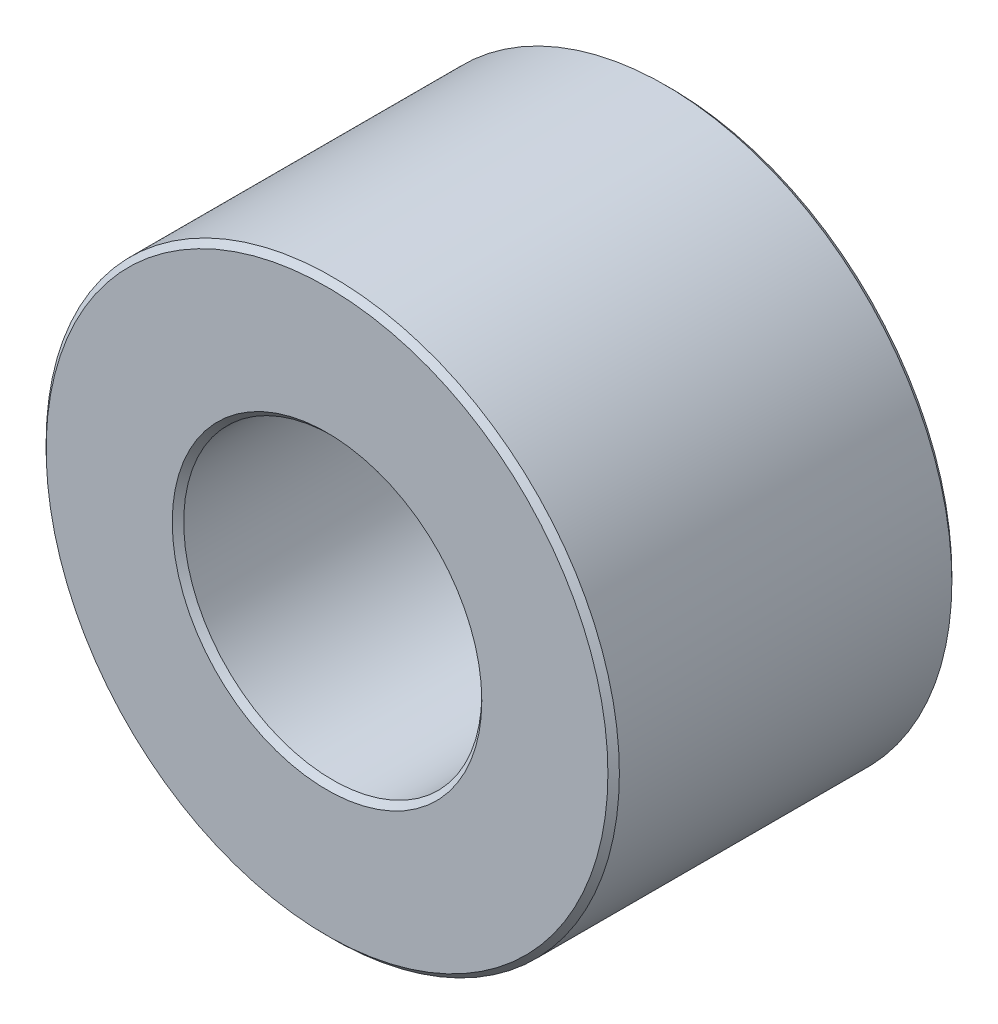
ISO-10303-21;
HEADER;
FILE_DESCRIPTION(('STEP AP214'),'2;1');
FILE_NAME('part.step','',(''),(''),'','','');
FILE_SCHEMA(('AUTOMOTIVE_DESIGN { 1 0 10303 214 1 1 1 1 }'));
ENDSEC;
DATA;
#1=APPLICATION_CONTEXT('core data for automotive mechanical design processes');
#2=APPLICATION_PROTOCOL_DEFINITION('international standard','automotive_design',2000,#1);
#3=PRODUCT_CONTEXT('',#1,'mechanical');
#4=PRODUCT('Part','Part','',(#3));
#5=PRODUCT_RELATED_PRODUCT_CATEGORY('part','',(#4));
#6=PRODUCT_DEFINITION_FORMATION('','',#4);
#7=PRODUCT_DEFINITION_CONTEXT('part definition',#1,'design');
#8=PRODUCT_DEFINITION('design','',#6,#7);
#9=PRODUCT_DEFINITION_SHAPE('','',#8);
#10=(LENGTH_UNIT() NAMED_UNIT(*) SI_UNIT(.MILLI.,.METRE.));
#11=(NAMED_UNIT(*) PLANE_ANGLE_UNIT() SI_UNIT($,.RADIAN.));
#12=(NAMED_UNIT(*) SI_UNIT($,.STERADIAN.) SOLID_ANGLE_UNIT());
#13=UNCERTAINTY_MEASURE_WITH_UNIT(LENGTH_MEASURE(1.E-05),#10,'distance_accuracy_value','');
#14=(GEOMETRIC_REPRESENTATION_CONTEXT(3) GLOBAL_UNCERTAINTY_ASSIGNED_CONTEXT((#13)) GLOBAL_UNIT_ASSIGNED_CONTEXT((#10,
#11,#12)) REPRESENTATION_CONTEXT('',''));
#15=CARTESIAN_POINT('',(0.,0.,0.));
#16=DIRECTION('',(0.,0.,1.));
#17=DIRECTION('',(1.,0.,0.));
#18=AXIS2_PLACEMENT_3D('',#15,#16,#17);
#19=CARTESIAN_POINT('',(0.,0.,3.));
#20=DIRECTION('',(0.,0.,1.));
#21=DIRECTION('',(1.,0.,0.));
#22=AXIS2_PLACEMENT_3D('',#19,#20,#21);
#23=PLANE('',#22);
#24=CARTESIAN_POINT('',(0.,0.,3.));
#25=DIRECTION('',(0.,0.,1.));
#26=DIRECTION('',(1.,0.,0.));
#27=AXIS2_PLACEMENT_3D('',#24,#25,#26);
#28=CIRCLE('',#27,2.7);
#29=CARTESIAN_POINT('',(2.7,0.,3.));
#30=VERTEX_POINT('',#29);
#31=EDGE_CURVE('E10',#30,#30,#28,.F.);
#32=ORIENTED_EDGE('',*,*,#31,.T.);
#33=EDGE_LOOP('',(#32));
#34=FACE_BOUND('',#33,.T.);
#35=CARTESIAN_POINT('',(0.,0.,3.));
#36=DIRECTION('',(0.,0.,1.));
#37=DIRECTION('',(1.,0.,0.));
#38=AXIS2_PLACEMENT_3D('',#35,#36,#37);
#39=CIRCLE('',#38,4.9);
#40=CARTESIAN_POINT('',(4.9,0.,3.));
#41=VERTEX_POINT('',#40);
#42=EDGE_CURVE('E45',#41,#41,#39,.T.);
#43=ORIENTED_EDGE('',*,*,#42,.T.);
#44=EDGE_LOOP('',(#43));
#45=FACE_BOUND('',#44,.T.);
#46=ADVANCED_FACE('F37',(#34,#45),#23,.T.);
#47=CARTESIAN_POINT('',(0.,0.,-3.));
#48=DIRECTION('',(0.,0.,1.));
#49=DIRECTION('',(1.,0.,0.));
#50=AXIS2_PLACEMENT_3D('',#47,#48,#49);
#51=PLANE('',#50);
#52=CARTESIAN_POINT('',(0.,0.,-3.));
#53=DIRECTION('',(0.,0.,1.));
#54=DIRECTION('',(1.,0.,0.));
#55=AXIS2_PLACEMENT_3D('',#52,#53,#54);
#56=CIRCLE('',#55,4.9);
#57=CARTESIAN_POINT('',(4.9,0.,-3.));
#58=VERTEX_POINT('',#57);
#59=EDGE_CURVE('E64',#58,#58,#56,.F.);
#60=ORIENTED_EDGE('',*,*,#59,.T.);
#61=EDGE_LOOP('',(#60));
#62=FACE_BOUND('',#61,.T.);
#63=CARTESIAN_POINT('',(0.,0.,-3.));
#64=DIRECTION('',(0.,0.,1.));
#65=DIRECTION('',(1.,0.,0.));
#66=AXIS2_PLACEMENT_3D('',#63,#64,#65);
#67=CIRCLE('',#66,2.7);
#68=CARTESIAN_POINT('',(2.7,0.,-3.));
#69=VERTEX_POINT('',#68);
#70=EDGE_CURVE('E67',#69,#69,#67,.T.);
#71=ORIENTED_EDGE('',*,*,#70,.T.);
#72=EDGE_LOOP('',(#71));
#73=FACE_BOUND('',#72,.T.);
#74=ADVANCED_FACE('F89',(#62,#73),#51,.F.);
#75=CARTESIAN_POINT('',(0.,0.,3.));
#76=DIRECTION('',(0.,0.,-1.));
#77=DIRECTION('',(-1.,0.,0.));
#78=AXIS2_PLACEMENT_3D('',#75,#76,#77);
#79=CYLINDRICAL_SURFACE('',#78,5.);
#80=CARTESIAN_POINT('',(0.,0.,-2.9));
#81=DIRECTION('',(0.,0.,1.));
#82=DIRECTION('',(1.,0.,0.));
#83=AXIS2_PLACEMENT_3D('',#80,#81,#82);
#84=CIRCLE('',#83,5.);
#85=CARTESIAN_POINT('',(5.,0.,-2.9));
#86=VERTEX_POINT('',#85);
#87=EDGE_CURVE('E71',#86,#86,#84,.T.);
#88=ORIENTED_EDGE('',*,*,#87,.T.);
#89=EDGE_LOOP('',(#88));
#90=FACE_BOUND('',#89,.T.);
#91=CARTESIAN_POINT('',(0.,0.,2.9));
#92=DIRECTION('',(0.,0.,1.));
#93=DIRECTION('',(1.,0.,0.));
#94=AXIS2_PLACEMENT_3D('',#91,#92,#93);
#95=CIRCLE('',#94,5.);
#96=CARTESIAN_POINT('',(5.,0.,2.9));
#97=VERTEX_POINT('',#96);
#98=EDGE_CURVE('E74',#97,#97,#95,.F.);
#99=ORIENTED_EDGE('',*,*,#98,.T.);
#100=EDGE_LOOP('',(#99));
#101=FACE_BOUND('',#100,.T.);
#102=ADVANCED_FACE('F78',(#90,#101),#79,.T.);
#103=CARTESIAN_POINT('',(0.,0.,3.));
#104=DIRECTION('',(0.,0.,-1.));
#105=DIRECTION('',(-1.,0.,0.));
#106=AXIS2_PLACEMENT_3D('',#103,#104,#105);
#107=CYLINDRICAL_SURFACE('',#106,2.6);
#108=CARTESIAN_POINT('',(0.,0.,-2.9));
#109=DIRECTION('',(0.,0.,1.));
#110=DIRECTION('',(1.,0.,0.));
#111=AXIS2_PLACEMENT_3D('',#108,#109,#110);
#112=CIRCLE('',#111,2.6);
#113=CARTESIAN_POINT('',(2.6,0.,-2.9));
#114=VERTEX_POINT('',#113);
#115=EDGE_CURVE('E52',#114,#114,#112,.F.);
#116=ORIENTED_EDGE('',*,*,#115,.T.);
#117=EDGE_LOOP('',(#116));
#118=FACE_BOUND('',#117,.T.);
#119=CARTESIAN_POINT('',(0.,0.,2.9));
#120=DIRECTION('',(0.,0.,1.));
#121=DIRECTION('',(1.,0.,0.));
#122=AXIS2_PLACEMENT_3D('',#119,#120,#121);
#123=CIRCLE('',#122,2.6);
#124=CARTESIAN_POINT('',(2.6,0.,2.9));
#125=VERTEX_POINT('',#124);
#126=EDGE_CURVE('E59',#125,#125,#123,.T.);
#127=ORIENTED_EDGE('',*,*,#126,.T.);
#128=EDGE_LOOP('',(#127));
#129=FACE_BOUND('',#128,.T.);
#130=ADVANCED_FACE('F97',(#118,#129),#107,.F.);
#131=CARTESIAN_POINT('',(0.,0.,-2.9));
#132=DIRECTION('',(0.,0.,1.));
#133=DIRECTION('',(1.,0.,0.));
#134=AXIS2_PLACEMENT_3D('',#131,#132,#133);
#135=CONICAL_SURFACE('',#134,5.,0.785398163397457);
#136=ORIENTED_EDGE('',*,*,#59,.F.);
#137=EDGE_LOOP('',(#136));
#138=FACE_BOUND('',#137,.T.);
#139=ORIENTED_EDGE('',*,*,#87,.F.);
#140=EDGE_LOOP('',(#139));
#141=FACE_BOUND('',#140,.T.);
#142=ADVANCED_FACE('F102',(#138,#141),#135,.T.);
#143=CARTESIAN_POINT('',(0.,0.,-3.));
#144=DIRECTION('',(0.,0.,-1.));
#145=DIRECTION('',(-1.,0.,0.));
#146=AXIS2_PLACEMENT_3D('',#143,#144,#145);
#147=CONICAL_SURFACE('',#146,2.7,0.785398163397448);
#148=ORIENTED_EDGE('',*,*,#115,.F.);
#149=EDGE_LOOP('',(#148));
#150=FACE_BOUND('',#149,.T.);
#151=ORIENTED_EDGE('',*,*,#70,.F.);
#152=EDGE_LOOP('',(#151));
#153=FACE_BOUND('',#152,.T.);
#154=ADVANCED_FACE('F86',(#150,#153),#147,.F.);
#155=CARTESIAN_POINT('',(0.,0.,2.9));
#156=DIRECTION('',(0.,0.,1.));
#157=DIRECTION('',(1.,0.,0.));
#158=AXIS2_PLACEMENT_3D('',#155,#156,#157);
#159=CONICAL_SURFACE('',#158,2.6,0.785398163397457);
#160=ORIENTED_EDGE('',*,*,#31,.F.);
#161=EDGE_LOOP('',(#160));
#162=FACE_BOUND('',#161,.T.);
#163=ORIENTED_EDGE('',*,*,#126,.F.);
#164=EDGE_LOOP('',(#163));
#165=FACE_BOUND('',#164,.T.);
#166=ADVANCED_FACE('F82',(#162,#165),#159,.F.);
#167=CARTESIAN_POINT('',(0.,0.,3.));
#168=DIRECTION('',(0.,0.,-1.));
#169=DIRECTION('',(-1.,0.,0.));
#170=AXIS2_PLACEMENT_3D('',#167,#168,#169);
#171=CONICAL_SURFACE('',#170,4.9,0.785398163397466);
#172=ORIENTED_EDGE('',*,*,#98,.F.);
#173=EDGE_LOOP('',(#172));
#174=FACE_BOUND('',#173,.T.);
#175=ORIENTED_EDGE('',*,*,#42,.F.);
#176=EDGE_LOOP('',(#175));
#177=FACE_BOUND('',#176,.T.);
#178=ADVANCED_FACE('F39',(#174,#177),#171,.T.);
#179=CLOSED_SHELL('',(#46,#74,#102,#130,#142,#154,#166,#178));
#180=MANIFOLD_SOLID_BREP('B2',#179);
#181=ADVANCED_BREP_SHAPE_REPRESENTATION('',(#18,#180),#14);
#182=SHAPE_DEFINITION_REPRESENTATION(#9,#181);
ENDSEC;
END-ISO-10303-21;
